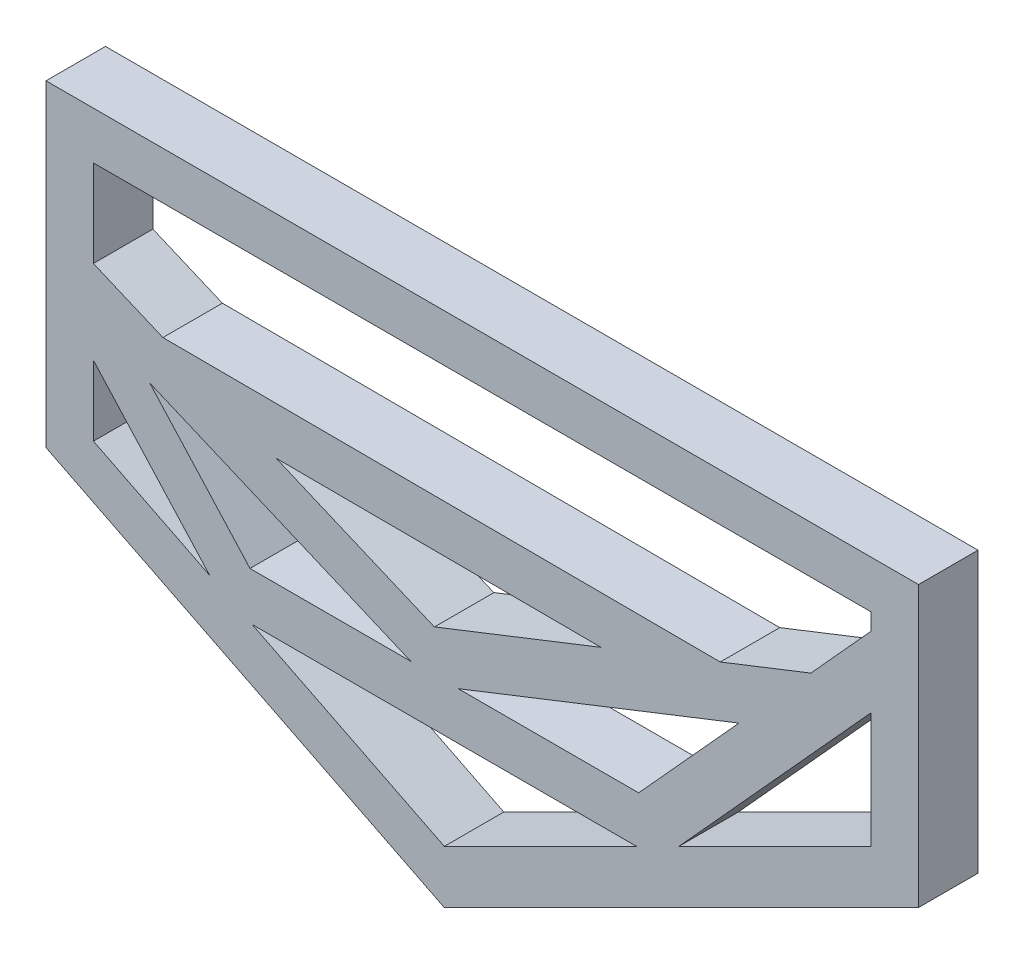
from build123d import *

# Parameters (mm, degrees)
BOSS_EXTRUDE1_DEPTH = 19


with BuildPart() as part:
    # Sketch1 → Boss-Extrude1 (new body)
    with BuildSketch(Plane.XY):
        Polygon((-83, 120.142857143), (-83, 18.685713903), (44.20000048, -44.914286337), (195.62857248, 30.799999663), (195.62857248, 120.142857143), align=None)
        Polygon((-67.8571428, 50.415164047), (-67.8571428, 28.044514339), (-30.714948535, 9.473417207), align=None, mode=Mode.SUBTRACT)
        Polygon((-67.8571428, 104.999999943), (-67.8571428, 77.195784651), (-45.668155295, 67.801982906), (132.322852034, 67.070135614), (161.25606592, 78.462693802), (180.48571528, 99.659487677), (180.48571528, 104.999999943), align=None, mode=Mode.SUBTRACT)
        Polygon((44.20000048, -27.984057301), (105.570766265, 2.701325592), (-17.170765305, 2.701325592), align=None, mode=Mode.SUBTRACT)
        Polygon((-9.548285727, 52.510483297), (94.262273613, 52.083644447), (41.065876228, 31.13736952), (41.065876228, 31.082763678), align=None, mode=Mode.SUBTRACT)
        Polygon((119.114949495, 9.473417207), (180.48571528, 77.122257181), (180.48571528, 40.158800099), align=None, mode=Mode.SUBTRACT)
        Polygon((-17.8631864, 17.844182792), (33.494447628, 17.844182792), (-49.887176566, 53.144146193), align=None, mode=Mode.SUBTRACT)
        Polygon((106.26318736, 17.844182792), (138.287177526, 53.144146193), (48.637304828, 17.844182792), align=None, mode=Mode.SUBTRACT)
    extrude(amount=BOSS_EXTRUDE1_DEPTH)


solid = part.part
